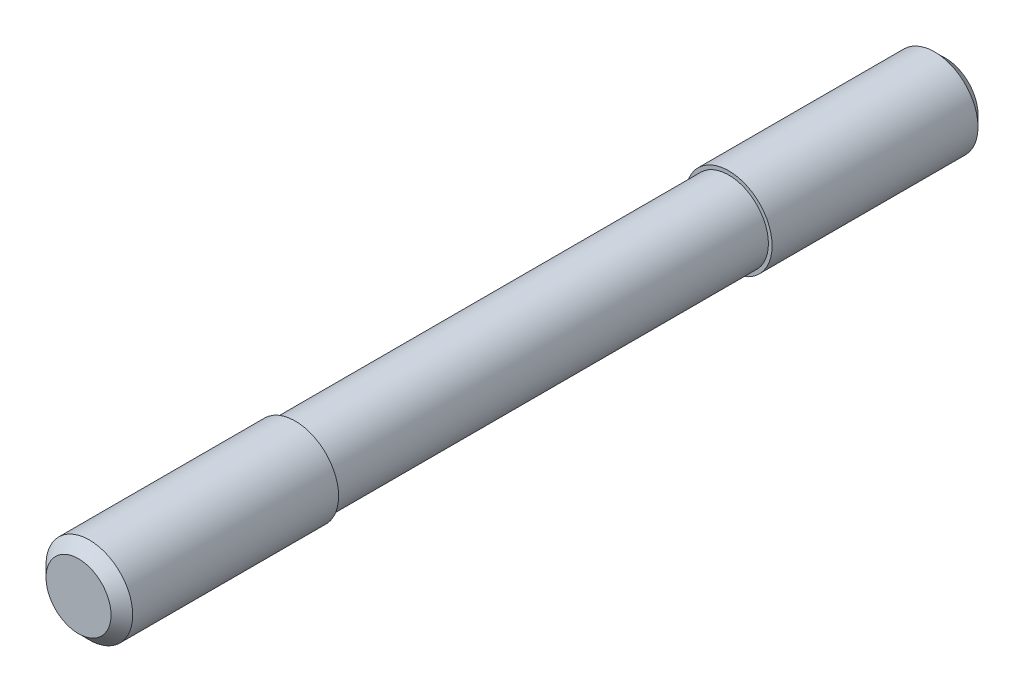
ISO-10303-21;
HEADER;
FILE_DESCRIPTION(('STEP AP214'),'2;1');
FILE_NAME('part.step','',(''),(''),'','','');
FILE_SCHEMA(('AUTOMOTIVE_DESIGN { 1 0 10303 214 1 1 1 1 }'));
ENDSEC;
DATA;
#1=APPLICATION_CONTEXT('core data for automotive mechanical design processes');
#2=APPLICATION_PROTOCOL_DEFINITION('international standard','automotive_design',2000,#1);
#3=PRODUCT_CONTEXT('',#1,'mechanical');
#4=PRODUCT('Part','Part','',(#3));
#5=PRODUCT_RELATED_PRODUCT_CATEGORY('part','',(#4));
#6=PRODUCT_DEFINITION_FORMATION('','',#4);
#7=PRODUCT_DEFINITION_CONTEXT('part definition',#1,'design');
#8=PRODUCT_DEFINITION('design','',#6,#7);
#9=PRODUCT_DEFINITION_SHAPE('','',#8);
#10=(LENGTH_UNIT() NAMED_UNIT(*) SI_UNIT(.MILLI.,.METRE.));
#11=(NAMED_UNIT(*) PLANE_ANGLE_UNIT() SI_UNIT($,.RADIAN.));
#12=(NAMED_UNIT(*) SI_UNIT($,.STERADIAN.) SOLID_ANGLE_UNIT());
#13=UNCERTAINTY_MEASURE_WITH_UNIT(LENGTH_MEASURE(1.E-05),#10,'distance_accuracy_value','');
#14=(GEOMETRIC_REPRESENTATION_CONTEXT(3) GLOBAL_UNCERTAINTY_ASSIGNED_CONTEXT((#13)) GLOBAL_UNIT_ASSIGNED_CONTEXT((#10,
#11,#12)) REPRESENTATION_CONTEXT('',''));
#15=CARTESIAN_POINT('',(0.,0.,0.));
#16=DIRECTION('',(0.,0.,1.));
#17=DIRECTION('',(1.,0.,0.));
#18=AXIS2_PLACEMENT_3D('',#15,#16,#17);
#19=CARTESIAN_POINT('',(0.,0.,0.));
#20=DIRECTION('',(0.,0.,1.));
#21=DIRECTION('',(1.,0.,0.));
#22=AXIS2_PLACEMENT_3D('',#19,#20,#21);
#23=PLANE('',#22);
#24=CARTESIAN_POINT('',(0.,0.,0.));
#25=DIRECTION('',(0.,0.,1.));
#26=DIRECTION('',(1.,0.,0.));
#27=AXIS2_PLACEMENT_3D('',#24,#25,#26);
#28=CIRCLE('',#27,7.5);
#29=CARTESIAN_POINT('',(7.5,0.,0.));
#30=VERTEX_POINT('',#29);
#31=EDGE_CURVE('E8',#30,#30,#28,.T.);
#32=ORIENTED_EDGE('',*,*,#31,.F.);
#33=EDGE_LOOP('',(#32));
#34=FACE_BOUND('',#33,.T.);
#35=ADVANCED_FACE('F12',(#34),#23,.F.);
#36=CARTESIAN_POINT('',(0.,0.,2.5));
#37=DIRECTION('',(0.,0.,1.));
#38=DIRECTION('',(1.,0.,0.));
#39=AXIS2_PLACEMENT_3D('',#36,#37,#38);
#40=CONICAL_SURFACE('',#39,10.,0.785398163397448);
#41=ORIENTED_EDGE('',*,*,#31,.T.);
#42=EDGE_LOOP('',(#41));
#43=FACE_BOUND('',#42,.T.);
#44=CARTESIAN_POINT('',(0.,0.,2.5));
#45=DIRECTION('',(0.,0.,1.));
#46=DIRECTION('',(1.,0.,0.));
#47=AXIS2_PLACEMENT_3D('',#44,#45,#46);
#48=CIRCLE('',#47,10.);
#49=CARTESIAN_POINT('',(10.,0.,2.5));
#50=VERTEX_POINT('',#49);
#51=EDGE_CURVE('E18',#50,#50,#48,.T.);
#52=ORIENTED_EDGE('',*,*,#51,.F.);
#53=EDGE_LOOP('',(#52));
#54=FACE_BOUND('',#53,.T.);
#55=ADVANCED_FACE('F61',(#43,#54),#40,.T.);
#56=CARTESIAN_POINT('',(0.,0.,70.));
#57=DIRECTION('',(0.,0.,1.));
#58=DIRECTION('',(1.,0.,0.));
#59=AXIS2_PLACEMENT_3D('',#56,#57,#58);
#60=CYLINDRICAL_SURFACE('',#59,10.);
#61=CARTESIAN_POINT('',(0.,0.,50.));
#62=DIRECTION('',(0.,0.,1.));
#63=DIRECTION('',(1.,0.,0.));
#64=AXIS2_PLACEMENT_3D('',#61,#62,#63);
#65=CIRCLE('',#64,10.);
#66=CARTESIAN_POINT('',(10.,0.,50.));
#67=VERTEX_POINT('',#66);
#68=EDGE_CURVE('E22',#67,#67,#65,.T.);
#69=ORIENTED_EDGE('',*,*,#68,.F.);
#70=EDGE_LOOP('',(#69));
#71=FACE_BOUND('',#70,.T.);
#72=ORIENTED_EDGE('',*,*,#51,.T.);
#73=EDGE_LOOP('',(#72));
#74=FACE_BOUND('',#73,.T.);
#75=ADVANCED_FACE('F66',(#71,#74),#60,.T.);
#76=CARTESIAN_POINT('',(10.,0.,50.));
#77=DIRECTION('',(0.,0.,-1.));
#78=DIRECTION('',(-1.,0.,0.));
#79=AXIS2_PLACEMENT_3D('',#76,#77,#78);
#80=PLANE('',#79);
#81=CARTESIAN_POINT('',(0.,0.,50.));
#82=DIRECTION('',(0.,0.,1.));
#83=DIRECTION('',(1.,0.,0.));
#84=AXIS2_PLACEMENT_3D('',#81,#82,#83);
#85=CIRCLE('',#84,9.15);
#86=CARTESIAN_POINT('',(9.15,0.,50.));
#87=VERTEX_POINT('',#86);
#88=EDGE_CURVE('E26',#87,#87,#85,.T.);
#89=ORIENTED_EDGE('',*,*,#88,.F.);
#90=EDGE_LOOP('',(#89));
#91=FACE_BOUND('',#90,.T.);
#92=ORIENTED_EDGE('',*,*,#68,.T.);
#93=EDGE_LOOP('',(#92));
#94=FACE_BOUND('',#93,.T.);
#95=ADVANCED_FACE('F70',(#91,#94),#80,.F.);
#96=CARTESIAN_POINT('',(0.,0.,70.));
#97=DIRECTION('',(0.,0.,1.));
#98=DIRECTION('',(1.,0.,0.));
#99=AXIS2_PLACEMENT_3D('',#96,#97,#98);
#100=CYLINDRICAL_SURFACE('',#99,9.15);
#101=CARTESIAN_POINT('',(0.,0.,150.));
#102=DIRECTION('',(0.,0.,1.));
#103=DIRECTION('',(1.,0.,0.));
#104=AXIS2_PLACEMENT_3D('',#101,#102,#103);
#105=CIRCLE('',#104,9.15);
#106=CARTESIAN_POINT('',(9.15,0.,150.));
#107=VERTEX_POINT('',#106);
#108=EDGE_CURVE('E31',#107,#107,#105,.T.);
#109=ORIENTED_EDGE('',*,*,#108,.F.);
#110=EDGE_LOOP('',(#109));
#111=FACE_BOUND('',#110,.T.);
#112=ORIENTED_EDGE('',*,*,#88,.T.);
#113=EDGE_LOOP('',(#112));
#114=FACE_BOUND('',#113,.T.);
#115=ADVANCED_FACE('F77',(#111,#114),#100,.T.);
#116=CARTESIAN_POINT('',(9.15,0.,150.));
#117=DIRECTION('',(0.,0.,1.));
#118=DIRECTION('',(1.,0.,0.));
#119=AXIS2_PLACEMENT_3D('',#116,#117,#118);
#120=PLANE('',#119);
#121=CARTESIAN_POINT('',(0.,0.,150.));
#122=DIRECTION('',(0.,0.,1.));
#123=DIRECTION('',(1.,0.,0.));
#124=AXIS2_PLACEMENT_3D('',#121,#122,#123);
#125=CIRCLE('',#124,10.);
#126=CARTESIAN_POINT('',(10.,0.,150.));
#127=VERTEX_POINT('',#126);
#128=EDGE_CURVE('E34',#127,#127,#125,.T.);
#129=ORIENTED_EDGE('',*,*,#128,.F.);
#130=EDGE_LOOP('',(#129));
#131=FACE_BOUND('',#130,.T.);
#132=ORIENTED_EDGE('',*,*,#108,.T.);
#133=EDGE_LOOP('',(#132));
#134=FACE_BOUND('',#133,.T.);
#135=ADVANCED_FACE('F57',(#131,#134),#120,.F.);
#136=CARTESIAN_POINT('',(0.,0.,70.));
#137=DIRECTION('',(0.,0.,1.));
#138=DIRECTION('',(1.,0.,0.));
#139=AXIS2_PLACEMENT_3D('',#136,#137,#138);
#140=CYLINDRICAL_SURFACE('',#139,10.);
#141=CARTESIAN_POINT('',(0.,0.,197.5));
#142=DIRECTION('',(0.,0.,1.));
#143=DIRECTION('',(1.,0.,0.));
#144=AXIS2_PLACEMENT_3D('',#141,#142,#143);
#145=CIRCLE('',#144,10.);
#146=CARTESIAN_POINT('',(10.,0.,197.5));
#147=VERTEX_POINT('',#146);
#148=EDGE_CURVE('E37',#147,#147,#145,.T.);
#149=ORIENTED_EDGE('',*,*,#148,.F.);
#150=EDGE_LOOP('',(#149));
#151=FACE_BOUND('',#150,.T.);
#152=ORIENTED_EDGE('',*,*,#128,.T.);
#153=EDGE_LOOP('',(#152));
#154=FACE_BOUND('',#153,.T.);
#155=ADVANCED_FACE('F48',(#151,#154),#140,.T.);
#156=CARTESIAN_POINT('',(0.,0.,200.));
#157=DIRECTION('',(0.,0.,-1.));
#158=DIRECTION('',(-1.,0.,0.));
#159=AXIS2_PLACEMENT_3D('',#156,#157,#158);
#160=CONICAL_SURFACE('',#159,7.5,0.785398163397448);
#161=ORIENTED_EDGE('',*,*,#148,.T.);
#162=EDGE_LOOP('',(#161));
#163=FACE_BOUND('',#162,.T.);
#164=CARTESIAN_POINT('',(0.,0.,200.));
#165=DIRECTION('',(0.,0.,1.));
#166=DIRECTION('',(1.,0.,0.));
#167=AXIS2_PLACEMENT_3D('',#164,#165,#166);
#168=CIRCLE('',#167,7.5);
#169=CARTESIAN_POINT('',(7.5,0.,200.));
#170=VERTEX_POINT('',#169);
#171=EDGE_CURVE('E40',#170,#170,#168,.T.);
#172=ORIENTED_EDGE('',*,*,#171,.F.);
#173=EDGE_LOOP('',(#172));
#174=FACE_BOUND('',#173,.T.);
#175=ADVANCED_FACE('F46',(#163,#174),#160,.T.);
#176=CARTESIAN_POINT('',(7.5,0.,200.));
#177=DIRECTION('',(0.,0.,-1.));
#178=DIRECTION('',(-1.,0.,0.));
#179=AXIS2_PLACEMENT_3D('',#176,#177,#178);
#180=PLANE('',#179);
#181=ORIENTED_EDGE('',*,*,#171,.T.);
#182=EDGE_LOOP('',(#181));
#183=FACE_BOUND('',#182,.T.);
#184=ADVANCED_FACE('F44',(#183),#180,.F.);
#185=CLOSED_SHELL('',(#35,#55,#75,#95,#115,#135,#155,#175,#184));
#186=MANIFOLD_SOLID_BREP('B1',#185);
#187=ADVANCED_BREP_SHAPE_REPRESENTATION('',(#18,#186),#14);
#188=SHAPE_DEFINITION_REPRESENTATION(#9,#187);
ENDSEC;
END-ISO-10303-21;
